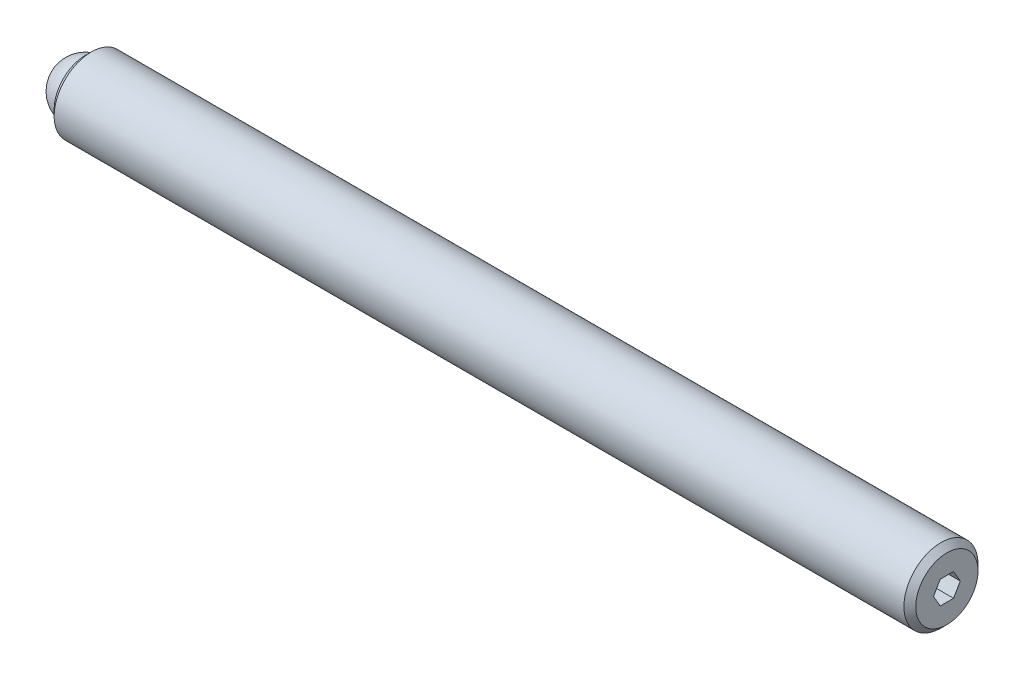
from build123d import *

# Parameters (mm, degrees)
SKETCH2_R           = 3.175
BOSS_EXTRUDE1_DEPTH = 73.81875
CHAMFER1_SIZE       = 0.508
CHAMFER2_SIZE       = 0.508
CUT_EXTRUDE2_DEPTH  = 2.286
SKETCH3_R           = 2.38125
CUT_EXTRUDE3_DEPTH  = 1.984375


with BuildPart() as part:
    # Sketch2 → Boss-Extrude1 (new body)
    with BuildSketch(Plane(origin=(0, 0, 0), x_dir=(0, 0, -1), z_dir=(1, 0, 0))):
        Circle(SKETCH2_R)
    extrude(amount=BOSS_EXTRUDE1_DEPTH)

    # Chamfer1
    chamfer1_edges = [part.edges().sort_by_distance(p)[0] for p in [
        (0, 0, 3.175),
    ]]
    chamfer(chamfer1_edges, length=CHAMFER1_SIZE)

    # Chamfer2
    chamfer2_edges = [part.edges().sort_by_distance(p)[0] for p in [
        (73.81875, 0, 3.175),
    ]]
    chamfer(chamfer2_edges, length=CHAMFER2_SIZE)

    # Sketch4 → Cut-Extrude2 (cut)
    with BuildSketch(Plane(origin=(73.81875, 0, 0), x_dir=(0, 0, -1), z_dir=(1, 0, 0))):
        Polygon((1.14567944, 0), (0.57283972, 0.9921875), (-0.57283972, 0.9921875), (-1.14567944, 0), (-0.57283972, -0.9921875), (0.57283972, -0.9921875), align=None)
    extrude(amount=-CUT_EXTRUDE2_DEPTH, mode=Mode.SUBTRACT)

    # Sketch3 → Cut-Extrude3 (cut)
    with BuildSketch(Plane.ZY):
        Circle(SKETCH3_R)
    extrude(amount=-CUT_EXTRUDE3_DEPTH, mode=Mode.SUBTRACT)


with BuildPart() as body_2:
    # Sketch5 → Revolve1 (revolve)
    with BuildSketch(Plane.ZY):
        with BuildLine():
            Line((0, 0), (0, -2.38125))
            ThreePointArc((0, -2.38125), (-2.38125, 0), (0, 2.38125))
            Line((0, 2.38125), (0, 0))
        make_face()
    revolve(axis=Axis((0, 0, 0), (0, 1, 0)))


solid = Compound([part.part, body_2.part])
